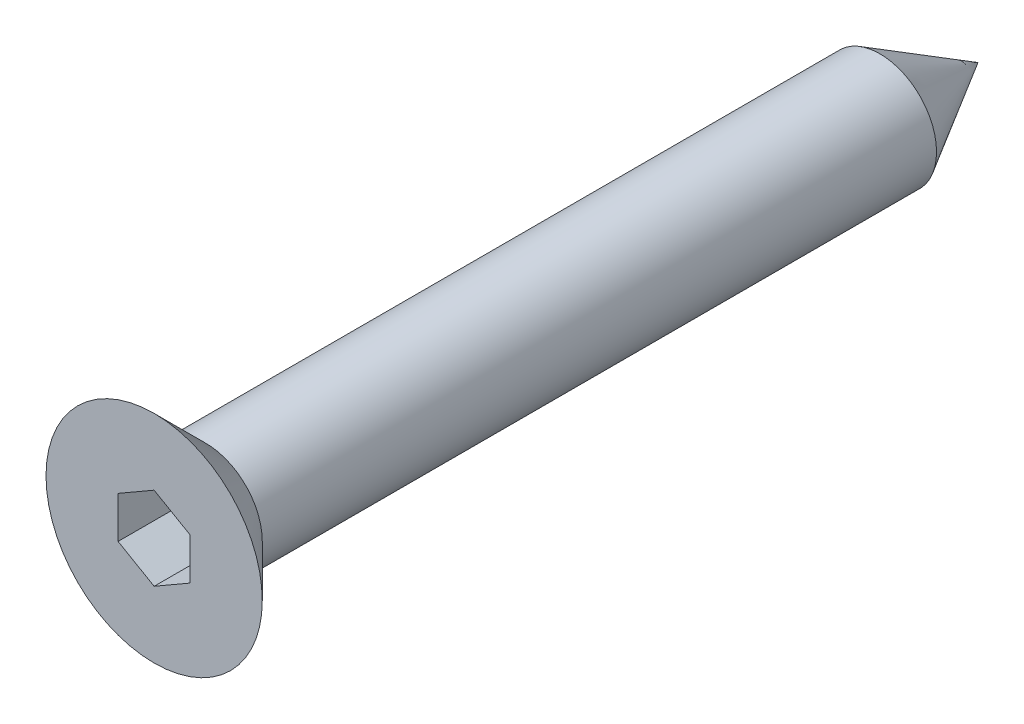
ISO-10303-21;
HEADER;
FILE_DESCRIPTION(('STEP AP214'),'2;1');
FILE_NAME('part.step','',(''),(''),'','','');
FILE_SCHEMA(('AUTOMOTIVE_DESIGN { 1 0 10303 214 1 1 1 1 }'));
ENDSEC;
DATA;
#1=APPLICATION_CONTEXT('core data for automotive mechanical design processes');
#2=APPLICATION_PROTOCOL_DEFINITION('international standard','automotive_design',2000,#1);
#3=PRODUCT_CONTEXT('',#1,'mechanical');
#4=PRODUCT('Part','Part','',(#3));
#5=PRODUCT_RELATED_PRODUCT_CATEGORY('part','',(#4));
#6=PRODUCT_DEFINITION_FORMATION('','',#4);
#7=PRODUCT_DEFINITION_CONTEXT('part definition',#1,'design');
#8=PRODUCT_DEFINITION('design','',#6,#7);
#9=PRODUCT_DEFINITION_SHAPE('','',#8);
#10=(LENGTH_UNIT() NAMED_UNIT(*) SI_UNIT(.MILLI.,.METRE.));
#11=(NAMED_UNIT(*) PLANE_ANGLE_UNIT() SI_UNIT($,.RADIAN.));
#12=(NAMED_UNIT(*) SI_UNIT($,.STERADIAN.) SOLID_ANGLE_UNIT());
#13=UNCERTAINTY_MEASURE_WITH_UNIT(LENGTH_MEASURE(1.E-05),#10,'distance_accuracy_value','');
#14=(GEOMETRIC_REPRESENTATION_CONTEXT(3) GLOBAL_UNCERTAINTY_ASSIGNED_CONTEXT((#13)) GLOBAL_UNIT_ASSIGNED_CONTEXT((#10,
#11,#12)) REPRESENTATION_CONTEXT('',''));
#15=CARTESIAN_POINT('',(0.,0.,0.));
#16=DIRECTION('',(0.,0.,1.));
#17=DIRECTION('',(1.,0.,0.));
#18=AXIS2_PLACEMENT_3D('',#15,#16,#17);
#19=CARTESIAN_POINT('',(0.,2.1,0.));
#20=DIRECTION('',(0.,0.,-1.));
#21=DIRECTION('',(-1.,0.,0.));
#22=AXIS2_PLACEMENT_3D('',#19,#20,#21);
#23=PLANE('',#22);
#24=DIRECTION('',(-0.866025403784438,-0.5,0.));
#25=VECTOR('',#24,1.);
#26=CARTESIAN_POINT('',(0.,0.808290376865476,0.));
#27=LINE('',#26,#25);
#28=CARTESIAN_POINT('',(0.,0.808290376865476,0.));
#29=VERTEX_POINT('',#28);
#30=CARTESIAN_POINT('',(-0.7,0.404145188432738,0.));
#31=VERTEX_POINT('',#30);
#32=EDGE_CURVE('E119',#29,#31,#27,.T.);
#33=ORIENTED_EDGE('',*,*,#32,.F.);
#34=DIRECTION('',(-0.866025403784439,0.5,0.));
#35=VECTOR('',#34,1.);
#36=CARTESIAN_POINT('',(0.699999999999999,0.404145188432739,0.));
#37=LINE('',#36,#35);
#38=CARTESIAN_POINT('',(0.699999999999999,0.404145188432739,0.));
#39=VERTEX_POINT('',#38);
#40=EDGE_CURVE('E49',#39,#29,#37,.T.);
#41=ORIENTED_EDGE('',*,*,#40,.F.);
#42=DIRECTION('',(0.,1.,0.));
#43=VECTOR('',#42,1.);
#44=CARTESIAN_POINT('',(0.7,-0.404145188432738,0.));
#45=LINE('',#44,#43);
#46=CARTESIAN_POINT('',(0.7,-0.404145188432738,0.));
#47=VERTEX_POINT('',#46);
#48=EDGE_CURVE('E105',#47,#39,#45,.T.);
#49=ORIENTED_EDGE('',*,*,#48,.F.);
#50=DIRECTION('',(0.866025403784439,0.5,0.));
#51=VECTOR('',#50,1.);
#52=CARTESIAN_POINT('',(0.,-0.808290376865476,0.));
#53=LINE('',#52,#51);
#54=CARTESIAN_POINT('',(0.,-0.808290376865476,0.));
#55=VERTEX_POINT('',#54);
#56=EDGE_CURVE('E108',#55,#47,#53,.T.);
#57=ORIENTED_EDGE('',*,*,#56,.F.);
#58=DIRECTION('',(0.866025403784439,-0.5,0.));
#59=VECTOR('',#58,1.);
#60=CARTESIAN_POINT('',(-0.7,-0.404145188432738,0.));
#61=LINE('',#60,#59);
#62=CARTESIAN_POINT('',(-0.7,-0.404145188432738,0.));
#63=VERTEX_POINT('',#62);
#64=EDGE_CURVE('E124',#63,#55,#61,.T.);
#65=ORIENTED_EDGE('',*,*,#64,.F.);
#66=DIRECTION('',(0.,-1.,0.));
#67=VECTOR('',#66,1.);
#68=CARTESIAN_POINT('',(-0.7,0.404145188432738,0.));
#69=LINE('',#68,#67);
#70=EDGE_CURVE('E121',#31,#63,#69,.T.);
#71=ORIENTED_EDGE('',*,*,#70,.F.);
#72=EDGE_LOOP('',(#33,#41,#49,#57,#65,#71));
#73=FACE_BOUND('',#72,.T.);
#74=CARTESIAN_POINT('',(0.,0.,0.));
#75=DIRECTION('',(0.,0.,1.));
#76=DIRECTION('',(1.,0.,0.));
#77=AXIS2_PLACEMENT_3D('',#74,#75,#76);
#78=CIRCLE('',#77,2.1);
#79=CARTESIAN_POINT('',(2.1,0.,0.));
#80=VERTEX_POINT('',#79);
#81=EDGE_CURVE('E42',#80,#80,#78,.T.);
#82=ORIENTED_EDGE('',*,*,#81,.T.);
#83=EDGE_LOOP('',(#82));
#84=FACE_BOUND('',#83,.T.);
#85=ADVANCED_FACE('F33',(#73,#84),#23,.F.);
#86=CARTESIAN_POINT('',(0.,0.,-1.));
#87=DIRECTION('',(0.,0.,1.));
#88=DIRECTION('',(1.,0.,0.));
#89=AXIS2_PLACEMENT_3D('',#86,#87,#88);
#90=CONICAL_SURFACE('',#89,1.1,0.785398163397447);
#91=ORIENTED_EDGE('',*,*,#81,.F.);
#92=EDGE_LOOP('',(#91));
#93=FACE_BOUND('',#92,.T.);
#94=CARTESIAN_POINT('',(0.,0.,-1.));
#95=DIRECTION('',(0.,0.,1.));
#96=DIRECTION('',(1.,0.,0.));
#97=AXIS2_PLACEMENT_3D('',#94,#95,#96);
#98=CIRCLE('',#97,1.1);
#99=CARTESIAN_POINT('',(1.1,0.,-1.));
#100=VERTEX_POINT('',#99);
#101=EDGE_CURVE('E131',#100,#100,#98,.T.);
#102=ORIENTED_EDGE('',*,*,#101,.T.);
#103=EDGE_LOOP('',(#102));
#104=FACE_BOUND('',#103,.T.);
#105=ADVANCED_FACE('F144',(#93,#104),#90,.T.);
#106=CARTESIAN_POINT('',(0.,0.,-16.));
#107=DIRECTION('',(0.,0.,1.));
#108=DIRECTION('',(1.,0.,0.));
#109=AXIS2_PLACEMENT_3D('',#106,#107,#108);
#110=CYLINDRICAL_SURFACE('',#109,1.1);
#111=CARTESIAN_POINT('',(0.,0.,-14.0947441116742));
#112=DIRECTION('',(0.,0.,1.));
#113=DIRECTION('',(1.,0.,0.));
#114=AXIS2_PLACEMENT_3D('',#111,#112,#113);
#115=CIRCLE('',#114,1.1);
#116=CARTESIAN_POINT('',(1.1,0.,-14.0947441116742));
#117=VERTEX_POINT('',#116);
#118=EDGE_CURVE('E11',#117,#117,#115,.T.);
#119=ORIENTED_EDGE('',*,*,#118,.T.);
#120=EDGE_LOOP('',(#119));
#121=FACE_BOUND('',#120,.T.);
#122=ORIENTED_EDGE('',*,*,#101,.F.);
#123=EDGE_LOOP('',(#122));
#124=FACE_BOUND('',#123,.T.);
#125=ADVANCED_FACE('F147',(#121,#124),#110,.T.);
#126=CARTESIAN_POINT('',(0.699999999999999,0.404145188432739,-1.5));
#127=DIRECTION('',(0.5,0.866025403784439,0.));
#128=DIRECTION('',(-0.866025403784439,0.5,0.));
#129=AXIS2_PLACEMENT_3D('',#126,#127,#128);
#130=PLANE('',#129);
#131=ORIENTED_EDGE('',*,*,#40,.T.);
#132=DIRECTION('',(0.,0.,1.));
#133=VECTOR('',#132,1.);
#134=CARTESIAN_POINT('',(0.,0.808290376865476,-1.5));
#135=LINE('',#134,#133);
#136=CARTESIAN_POINT('',(0.,0.808290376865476,-1.5));
#137=VERTEX_POINT('',#136);
#138=EDGE_CURVE('E82',#137,#29,#135,.T.);
#139=ORIENTED_EDGE('',*,*,#138,.F.);
#140=DIRECTION('',(-0.866025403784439,0.5,0.));
#141=VECTOR('',#140,1.);
#142=CARTESIAN_POINT('',(0.699999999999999,0.404145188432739,-1.5));
#143=LINE('',#142,#141);
#144=CARTESIAN_POINT('',(0.699999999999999,0.404145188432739,-1.5));
#145=VERTEX_POINT('',#144);
#146=EDGE_CURVE('E86',#145,#137,#143,.T.);
#147=ORIENTED_EDGE('',*,*,#146,.F.);
#148=DIRECTION('',(0.,0.,1.));
#149=VECTOR('',#148,1.);
#150=CARTESIAN_POINT('',(0.699999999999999,0.404145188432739,-1.5));
#151=LINE('',#150,#149);
#152=EDGE_CURVE('E129',#145,#39,#151,.T.);
#153=ORIENTED_EDGE('',*,*,#152,.T.);
#154=EDGE_LOOP('',(#131,#139,#147,#153));
#155=FACE_BOUND('',#154,.T.);
#156=ADVANCED_FACE('F84',(#155),#130,.F.);
#157=CARTESIAN_POINT('',(0.7,-0.404145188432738,-1.5));
#158=DIRECTION('',(1.,0.,0.));
#159=DIRECTION('',(0.,1.,0.));
#160=AXIS2_PLACEMENT_3D('',#157,#158,#159);
#161=PLANE('',#160);
#162=ORIENTED_EDGE('',*,*,#48,.T.);
#163=ORIENTED_EDGE('',*,*,#152,.F.);
#164=DIRECTION('',(0.,1.,0.));
#165=VECTOR('',#164,1.);
#166=CARTESIAN_POINT('',(0.7,-0.404145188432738,-1.5));
#167=LINE('',#166,#165);
#168=CARTESIAN_POINT('',(0.7,-0.404145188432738,-1.5));
#169=VERTEX_POINT('',#168);
#170=EDGE_CURVE('E92',#169,#145,#167,.T.);
#171=ORIENTED_EDGE('',*,*,#170,.F.);
#172=DIRECTION('',(0.,0.,1.));
#173=VECTOR('',#172,1.);
#174=CARTESIAN_POINT('',(0.7,-0.404145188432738,-1.5));
#175=LINE('',#174,#173);
#176=EDGE_CURVE('E132',#169,#47,#175,.T.);
#177=ORIENTED_EDGE('',*,*,#176,.T.);
#178=EDGE_LOOP('',(#162,#163,#171,#177));
#179=FACE_BOUND('',#178,.T.);
#180=ADVANCED_FACE('F157',(#179),#161,.F.);
#181=CARTESIAN_POINT('',(0.,-0.808290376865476,-1.5));
#182=DIRECTION('',(0.5,-0.866025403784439,0.));
#183=DIRECTION('',(0.866025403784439,0.5,0.));
#184=AXIS2_PLACEMENT_3D('',#181,#182,#183);
#185=PLANE('',#184);
#186=ORIENTED_EDGE('',*,*,#56,.T.);
#187=ORIENTED_EDGE('',*,*,#176,.F.);
#188=DIRECTION('',(0.866025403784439,0.5,0.));
#189=VECTOR('',#188,1.);
#190=CARTESIAN_POINT('',(0.,-0.808290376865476,-1.5));
#191=LINE('',#190,#189);
#192=CARTESIAN_POINT('',(0.,-0.808290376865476,-1.5));
#193=VERTEX_POINT('',#192);
#194=EDGE_CURVE('E115',#193,#169,#191,.T.);
#195=ORIENTED_EDGE('',*,*,#194,.F.);
#196=DIRECTION('',(0.,0.,1.));
#197=VECTOR('',#196,1.);
#198=CARTESIAN_POINT('',(0.,-0.808290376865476,-1.5));
#199=LINE('',#198,#197);
#200=EDGE_CURVE('E134',#193,#55,#199,.T.);
#201=ORIENTED_EDGE('',*,*,#200,.T.);
#202=EDGE_LOOP('',(#186,#187,#195,#201));
#203=FACE_BOUND('',#202,.T.);
#204=ADVANCED_FACE('F174',(#203),#185,.F.);
#205=CARTESIAN_POINT('',(-0.7,-0.404145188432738,-1.5));
#206=DIRECTION('',(-0.5,-0.866025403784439,0.));
#207=DIRECTION('',(0.866025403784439,-0.5,0.));
#208=AXIS2_PLACEMENT_3D('',#205,#206,#207);
#209=PLANE('',#208);
#210=ORIENTED_EDGE('',*,*,#64,.T.);
#211=ORIENTED_EDGE('',*,*,#200,.F.);
#212=DIRECTION('',(0.866025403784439,-0.5,0.));
#213=VECTOR('',#212,1.);
#214=CARTESIAN_POINT('',(-0.7,-0.404145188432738,-1.5));
#215=LINE('',#214,#213);
#216=CARTESIAN_POINT('',(-0.7,-0.404145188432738,-1.5));
#217=VERTEX_POINT('',#216);
#218=EDGE_CURVE('E112',#217,#193,#215,.T.);
#219=ORIENTED_EDGE('',*,*,#218,.F.);
#220=DIRECTION('',(0.,0.,1.));
#221=VECTOR('',#220,1.);
#222=CARTESIAN_POINT('',(-0.7,-0.404145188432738,-1.5));
#223=LINE('',#222,#221);
#224=EDGE_CURVE('E136',#217,#63,#223,.T.);
#225=ORIENTED_EDGE('',*,*,#224,.T.);
#226=EDGE_LOOP('',(#210,#211,#219,#225));
#227=FACE_BOUND('',#226,.T.);
#228=ADVANCED_FACE('F172',(#227),#209,.F.);
#229=CARTESIAN_POINT('',(-0.7,0.404145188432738,-1.5));
#230=DIRECTION('',(-1.,0.,0.));
#231=DIRECTION('',(0.,-1.,0.));
#232=AXIS2_PLACEMENT_3D('',#229,#230,#231);
#233=PLANE('',#232);
#234=ORIENTED_EDGE('',*,*,#70,.T.);
#235=ORIENTED_EDGE('',*,*,#224,.F.);
#236=DIRECTION('',(0.,-1.,0.));
#237=VECTOR('',#236,1.);
#238=CARTESIAN_POINT('',(-0.7,0.404145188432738,-1.5));
#239=LINE('',#238,#237);
#240=CARTESIAN_POINT('',(-0.7,0.404145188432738,-1.5));
#241=VERTEX_POINT('',#240);
#242=EDGE_CURVE('E100',#241,#217,#239,.T.);
#243=ORIENTED_EDGE('',*,*,#242,.F.);
#244=DIRECTION('',(0.,0.,1.));
#245=VECTOR('',#244,1.);
#246=CARTESIAN_POINT('',(-0.7,0.404145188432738,-1.5));
#247=LINE('',#246,#245);
#248=EDGE_CURVE('E91',#241,#31,#247,.T.);
#249=ORIENTED_EDGE('',*,*,#248,.T.);
#250=EDGE_LOOP('',(#234,#235,#243,#249));
#251=FACE_BOUND('',#250,.T.);
#252=ADVANCED_FACE('F168',(#251),#233,.F.);
#253=CARTESIAN_POINT('',(0.,0.808290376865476,-1.5));
#254=DIRECTION('',(-0.5,0.866025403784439,0.));
#255=DIRECTION('',(-0.866025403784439,-0.5,0.));
#256=AXIS2_PLACEMENT_3D('',#253,#254,#255);
#257=PLANE('',#256);
#258=ORIENTED_EDGE('',*,*,#32,.T.);
#259=ORIENTED_EDGE('',*,*,#248,.F.);
#260=DIRECTION('',(-0.866025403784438,-0.5,0.));
#261=VECTOR('',#260,1.);
#262=CARTESIAN_POINT('',(0.,0.808290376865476,-1.5));
#263=LINE('',#262,#261);
#264=EDGE_CURVE('E95',#137,#241,#263,.T.);
#265=ORIENTED_EDGE('',*,*,#264,.F.);
#266=ORIENTED_EDGE('',*,*,#138,.T.);
#267=EDGE_LOOP('',(#258,#259,#265,#266));
#268=FACE_BOUND('',#267,.T.);
#269=ADVANCED_FACE('F96',(#268),#257,.F.);
#270=CARTESIAN_POINT('',(0.,0.808290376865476,-1.5));
#271=DIRECTION('',(0.,0.,1.));
#272=DIRECTION('',(1.,0.,0.));
#273=AXIS2_PLACEMENT_3D('',#270,#271,#272);
#274=PLANE('',#273);
#275=ORIENTED_EDGE('',*,*,#146,.T.);
#276=ORIENTED_EDGE('',*,*,#264,.T.);
#277=ORIENTED_EDGE('',*,*,#242,.T.);
#278=ORIENTED_EDGE('',*,*,#218,.T.);
#279=ORIENTED_EDGE('',*,*,#194,.T.);
#280=ORIENTED_EDGE('',*,*,#170,.T.);
#281=EDGE_LOOP('',(#275,#276,#277,#278,#279,#280));
#282=FACE_BOUND('',#281,.T.);
#283=ADVANCED_FACE('F102',(#282),#274,.T.);
#284=CARTESIAN_POINT('',(0.,0.,-14.0947441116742));
#285=DIRECTION('',(0.,0.,1.));
#286=DIRECTION('',(1.,0.,0.));
#287=AXIS2_PLACEMENT_3D('',#284,#285,#286);
#288=CONICAL_SURFACE('',#287,1.10000000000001,0.5235987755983);
#289=CARTESIAN_POINT('',(0.,0.,-16.));
#290=VERTEX_POINT('',#289);
#291=VERTEX_LOOP('',#290);
#292=FACE_BOUND('',#291,.T.);
#293=ORIENTED_EDGE('',*,*,#118,.F.);
#294=EDGE_LOOP('',(#293));
#295=FACE_BOUND('',#294,.T.);
#296=ADVANCED_FACE('F35',(#292,#295),#288,.T.);
#297=CLOSED_SHELL('',(#85,#105,#125,#156,#180,#204,#228,#252,#269,#283,#296));
#298=MANIFOLD_SOLID_BREP('B2',#297);
#299=ADVANCED_BREP_SHAPE_REPRESENTATION('',(#18,#298),#14);
#300=SHAPE_DEFINITION_REPRESENTATION(#9,#299);
ENDSEC;
END-ISO-10303-21;
